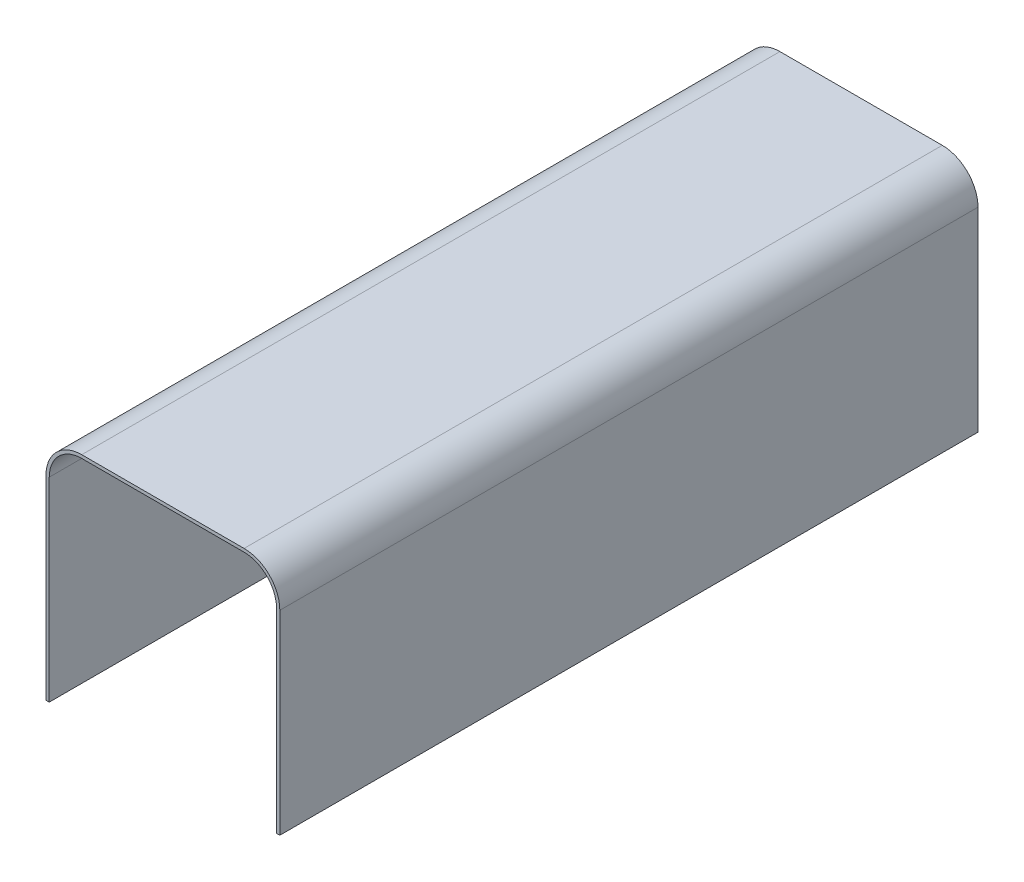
from build123d import *

# Parameters (mm, degrees)
BOSS_EXTRUDE1_DEPTH = 215


with BuildPart() as part:
    # Sketch1 → Boss-Extrude1 (new body)
    with BuildSketch(Plane.XY):
        with BuildLine():
            Line((0, 0), (0, 60))
            ThreePointArc((0, 60), (2.928932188, 67.071067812), (10, 70))
            Line((10, 70), (60, 70))
            ThreePointArc((60, 70), (67.071067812, 67.071067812), (70, 60))
            Line((70, 60), (70, 0))
            Line((70, 0), (71, 0))
            Line((71, 0), (71, 60))
            ThreePointArc((71, 60), (67.778174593, 67.778174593), (60, 71))
            Line((60, 71), (10, 71))
            ThreePointArc((10, 71), (2.221825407, 67.778174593), (-1, 60))
            Line((-1, 60), (-1, 0))
            Line((-1, 0), (0, 0))
        make_face()
    extrude(amount=BOSS_EXTRUDE1_DEPTH)


solid = part.part
